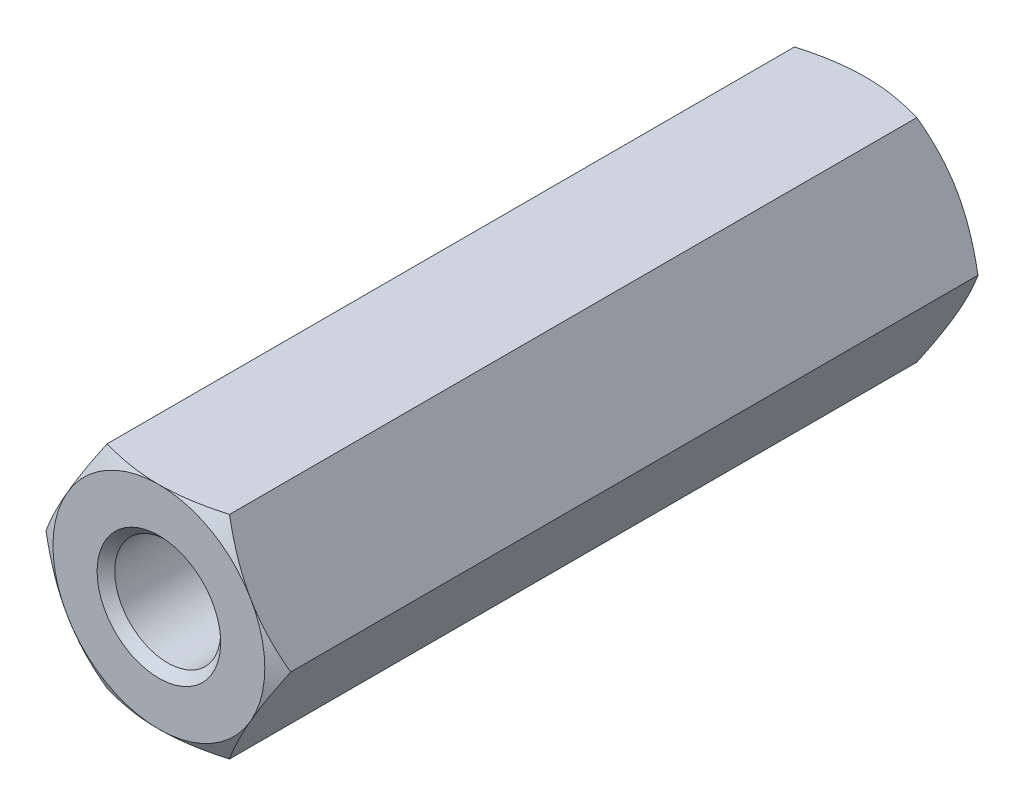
ISO-10303-21;
HEADER;
FILE_DESCRIPTION(('STEP AP214'),'2;1');
FILE_NAME('part.step','',(''),(''),'','','');
FILE_SCHEMA(('AUTOMOTIVE_DESIGN { 1 0 10303 214 1 1 1 1 }'));
ENDSEC;
DATA;
#1=APPLICATION_CONTEXT('core data for automotive mechanical design processes');
#2=APPLICATION_PROTOCOL_DEFINITION('international standard','automotive_design',2000,#1);
#3=PRODUCT_CONTEXT('',#1,'mechanical');
#4=PRODUCT('Part','Part','',(#3));
#5=PRODUCT_RELATED_PRODUCT_CATEGORY('part','',(#4));
#6=PRODUCT_DEFINITION_FORMATION('','',#4);
#7=PRODUCT_DEFINITION_CONTEXT('part definition',#1,'design');
#8=PRODUCT_DEFINITION('design','',#6,#7);
#9=PRODUCT_DEFINITION_SHAPE('','',#8);
#10=(LENGTH_UNIT() NAMED_UNIT(*) SI_UNIT(.MILLI.,.METRE.));
#11=(NAMED_UNIT(*) PLANE_ANGLE_UNIT() SI_UNIT($,.RADIAN.));
#12=(NAMED_UNIT(*) SI_UNIT($,.STERADIAN.) SOLID_ANGLE_UNIT());
#13=UNCERTAINTY_MEASURE_WITH_UNIT(LENGTH_MEASURE(1.E-05),#10,'distance_accuracy_value','');
#14=(GEOMETRIC_REPRESENTATION_CONTEXT(3) GLOBAL_UNCERTAINTY_ASSIGNED_CONTEXT((#13)) GLOBAL_UNIT_ASSIGNED_CONTEXT((#10,
#11,#12)) REPRESENTATION_CONTEXT('',''));
#15=CARTESIAN_POINT('',(0.,0.,0.));
#16=DIRECTION('',(0.,0.,1.));
#17=DIRECTION('',(1.,0.,0.));
#18=AXIS2_PLACEMENT_3D('',#15,#16,#17);
#19=CARTESIAN_POINT('',(3.46410161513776,0.,-10.));
#20=DIRECTION('',(0.866025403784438,0.5,0.));
#21=DIRECTION('',(-0.5,0.866025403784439,0.));
#22=AXIS2_PLACEMENT_3D('',#19,#20,#21);
#23=PLANE('',#22);
#24=CARTESIAN_POINT('',(3.46421708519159,-0.000199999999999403,9.73198413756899));
#25=CARTESIAN_POINT('',(3.38810199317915,0.131635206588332,9.77594629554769));
#26=CARTESIAN_POINT('',(3.31132988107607,0.26460840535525,9.81592841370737));
#27=CARTESIAN_POINT('',(3.15645624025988,0.532857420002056,9.88571791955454));
#28=CARTESIAN_POINT('',(3.078351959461,0.668138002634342,9.91550061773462));
#29=CARTESIAN_POINT('',(2.92311136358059,0.937022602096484,9.96186216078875));
#30=CARTESIAN_POINT('',(2.84599893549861,1.07058524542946,9.97874955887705));
#31=CARTESIAN_POINT('',(2.6914112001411,1.33833905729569,9.99891035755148));
#32=CARTESIAN_POINT('',(2.61393645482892,1.47252925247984,10.0022004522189));
#33=CARTESIAN_POINT('',(2.46916798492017,1.72327559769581,9.99535946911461));
#34=CARTESIAN_POINT('',(2.40185259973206,1.83986926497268,9.98690808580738));
#35=CARTESIAN_POINT('',(2.2676603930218,2.07229698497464,9.96012105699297));
#36=CARTESIAN_POINT('',(2.2007840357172,2.18813023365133,9.94177625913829));
#37=CARTESIAN_POINT('',(2.06631510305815,2.42103725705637,9.89591524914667));
#38=CARTESIAN_POINT('',(1.99873954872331,2.53808155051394,9.86820461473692));
#39=CARTESIAN_POINT('',(1.86459637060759,2.77042435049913,9.8053122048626));
#40=CARTESIAN_POINT('',(1.79802702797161,2.88572583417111,9.77014520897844));
#41=CARTESIAN_POINT('',(1.73193533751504,3.0002,9.73198413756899));
#42=B_SPLINE_CURVE_WITH_KNOTS('',3,(#24,#25,#26,#27,#28,#29,#30,#31,#32,#33,#34,#35,#36,#37,#38,
#39,#40,#41),.UNSPECIFIED.,.F.,.F.,(4,2,2,2,2,2,2,2,4),(0.,0.475539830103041,0.952222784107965,
1.41710776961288,1.88142182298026,2.28572436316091,2.69040156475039,3.10405572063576,
3.5168974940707),.UNSPECIFIED.);
#43=CARTESIAN_POINT('',(3.46410161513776,0.,9.73205080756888));
#44=VERTEX_POINT('',#43);
#45=CARTESIAN_POINT('',(2.59807621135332,1.5,10.));
#46=VERTEX_POINT('',#45);
#47=EDGE_CURVE('E127',#44,#46,#42,.T.);
#48=ORIENTED_EDGE('',*,*,#47,.F.);
#49=DIRECTION('',(0.,0.,1.));
#50=VECTOR('',#49,1.);
#51=CARTESIAN_POINT('',(3.46410161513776,0.,-10.));
#52=LINE('',#51,#50);
#53=CARTESIAN_POINT('',(3.46410161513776,0.,-9.73205080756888));
#54=VERTEX_POINT('',#53);
#55=EDGE_CURVE('E569',#54,#44,#52,.T.);
#56=ORIENTED_EDGE('',*,*,#55,.F.);
#57=CARTESIAN_POINT('',(3.46421708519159,-0.000199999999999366,-9.73198413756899));
#58=CARTESIAN_POINT('',(3.38810199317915,0.131635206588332,-9.77594629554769));
#59=CARTESIAN_POINT('',(3.31132988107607,0.26460840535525,-9.81592841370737));
#60=CARTESIAN_POINT('',(3.15645624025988,0.532857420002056,-9.88571791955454));
#61=CARTESIAN_POINT('',(3.078351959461,0.668138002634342,-9.91550061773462));
#62=CARTESIAN_POINT('',(2.92311136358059,0.937022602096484,-9.96186216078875));
#63=CARTESIAN_POINT('',(2.84599893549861,1.07058524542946,-9.97874955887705));
#64=CARTESIAN_POINT('',(2.6914112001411,1.33833905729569,-9.99891035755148));
#65=CARTESIAN_POINT('',(2.61393645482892,1.47252925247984,-10.0022004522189));
#66=CARTESIAN_POINT('',(2.46916798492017,1.72327559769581,-9.99535946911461));
#67=CARTESIAN_POINT('',(2.40185259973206,1.83986926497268,-9.98690808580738));
#68=CARTESIAN_POINT('',(2.2676603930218,2.07229698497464,-9.96012105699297));
#69=CARTESIAN_POINT('',(2.2007840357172,2.18813023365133,-9.94177625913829));
#70=CARTESIAN_POINT('',(2.06631510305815,2.42103725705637,-9.89591524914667));
#71=CARTESIAN_POINT('',(1.99873954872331,2.53808155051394,-9.86820461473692));
#72=CARTESIAN_POINT('',(1.86459637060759,2.77042435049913,-9.8053122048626));
#73=CARTESIAN_POINT('',(1.79802702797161,2.88572583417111,-9.77014520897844));
#74=CARTESIAN_POINT('',(1.73193533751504,3.0002,-9.73198413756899));
#75=B_SPLINE_CURVE_WITH_KNOTS('',3,(#57,#58,#59,#60,#61,#62,#63,#64,#65,#66,#67,#68,#69,#70,#71,
#72,#73,#74),.UNSPECIFIED.,.F.,.F.,(4,2,2,2,2,2,2,2,4),(0.,0.475539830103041,0.952222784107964,
1.41710776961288,1.88142182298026,2.28572436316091,2.69040156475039,3.10405572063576,
3.5168974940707),.UNSPECIFIED.);
#76=CARTESIAN_POINT('',(2.59807621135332,1.5,-10.));
#77=VERTEX_POINT('',#76);
#78=EDGE_CURVE('E544',#54,#77,#75,.T.);
#79=ORIENTED_EDGE('',*,*,#78,.T.);
#80=CARTESIAN_POINT('',(1.73205080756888,3.,-9.73205080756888));
#81=VERTEX_POINT('',#80);
#82=EDGE_CURVE('E268',#77,#81,#75,.T.);
#83=ORIENTED_EDGE('',*,*,#82,.T.);
#84=DIRECTION('',(0.,0.,1.));
#85=VECTOR('',#84,1.);
#86=CARTESIAN_POINT('',(1.73205080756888,3.,-10.));
#87=LINE('',#86,#85);
#88=CARTESIAN_POINT('',(1.73205080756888,3.,9.73205080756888));
#89=VERTEX_POINT('',#88);
#90=EDGE_CURVE('E159',#81,#89,#87,.T.);
#91=ORIENTED_EDGE('',*,*,#90,.T.);
#92=EDGE_CURVE('E140',#46,#89,#42,.T.);
#93=ORIENTED_EDGE('',*,*,#92,.F.);
#94=EDGE_LOOP('',(#48,#56,#79,#83,#91,#93));
#95=FACE_BOUND('',#94,.T.);
#96=ADVANCED_FACE('F41',(#95),#23,.T.);
#97=CARTESIAN_POINT('',(1.73205080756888,-3.,-10.));
#98=DIRECTION('',(0.866025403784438,-0.5,0.));
#99=DIRECTION('',(0.5,0.866025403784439,0.));
#100=AXIS2_PLACEMENT_3D('',#97,#98,#99);
#101=PLANE('',#100);
#102=CARTESIAN_POINT('',(1.73193533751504,-3.0002,9.73198413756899));
#103=CARTESIAN_POINT('',(1.80805042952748,-2.86836479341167,9.77594629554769));
#104=CARTESIAN_POINT('',(1.88482254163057,-2.73539159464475,9.81592841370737));
#105=CARTESIAN_POINT('',(2.03969618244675,-2.46714257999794,9.88571791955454));
#106=CARTESIAN_POINT('',(2.11780046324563,-2.33186199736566,9.91550061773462));
#107=CARTESIAN_POINT('',(2.27304105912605,-2.06297739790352,9.96186216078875));
#108=CARTESIAN_POINT('',(2.35015348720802,-1.92941475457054,9.97874955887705));
#109=CARTESIAN_POINT('',(2.50474122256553,-1.66166094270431,9.99891035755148));
#110=CARTESIAN_POINT('',(2.58221596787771,-1.52747074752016,10.0022004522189));
#111=CARTESIAN_POINT('',(2.72698443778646,-1.27672440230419,9.99535946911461));
#112=CARTESIAN_POINT('',(2.79429982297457,-1.16013073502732,9.98690808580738));
#113=CARTESIAN_POINT('',(2.92849202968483,-0.927703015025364,9.96012105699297));
#114=CARTESIAN_POINT('',(2.99536838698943,-0.811869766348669,9.94177625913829));
#115=CARTESIAN_POINT('',(3.12983731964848,-0.578962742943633,9.89591524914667));
#116=CARTESIAN_POINT('',(3.19741287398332,-0.461918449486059,9.86820461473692));
#117=CARTESIAN_POINT('',(3.33155605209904,-0.229575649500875,9.8053122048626));
#118=CARTESIAN_POINT('',(3.39812539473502,-0.114274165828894,9.77014520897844));
#119=CARTESIAN_POINT('',(3.46421708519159,0.000200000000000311,9.73198413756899));
#120=B_SPLINE_CURVE_WITH_KNOTS('',3,(#102,#103,#104,#105,#106,#107,#108,#109,#110,#111,#112,
#113,#114,#115,#116,#117,#118,#119),.UNSPECIFIED.,.F.,.F.,(4,2,2,2,2,2,2,2,4),(0.,
0.47553983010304,0.952222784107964,1.41710776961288,1.88142182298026,2.28572436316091,
2.69040156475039,3.10405572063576,3.5168974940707),.UNSPECIFIED.);
#121=CARTESIAN_POINT('',(1.73205080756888,-3.,9.73205080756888));
#122=VERTEX_POINT('',#121);
#123=CARTESIAN_POINT('',(2.59807621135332,-1.5,10.));
#124=VERTEX_POINT('',#123);
#125=EDGE_CURVE('E551',#122,#124,#120,.T.);
#126=ORIENTED_EDGE('',*,*,#125,.F.);
#127=DIRECTION('',(0.,0.,1.));
#128=VECTOR('',#127,1.);
#129=CARTESIAN_POINT('',(1.73205080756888,-3.,-10.));
#130=LINE('',#129,#128);
#131=CARTESIAN_POINT('',(1.73205080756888,-3.,-9.73205080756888));
#132=VERTEX_POINT('',#131);
#133=EDGE_CURVE('E282',#132,#122,#130,.T.);
#134=ORIENTED_EDGE('',*,*,#133,.F.);
#135=CARTESIAN_POINT('',(1.73193533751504,-3.0002,-9.73198413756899));
#136=CARTESIAN_POINT('',(1.80805042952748,-2.86836479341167,-9.77594629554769));
#137=CARTESIAN_POINT('',(1.88482254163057,-2.73539159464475,-9.81592841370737));
#138=CARTESIAN_POINT('',(2.03969618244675,-2.46714257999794,-9.88571791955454));
#139=CARTESIAN_POINT('',(2.11780046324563,-2.33186199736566,-9.91550061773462));
#140=CARTESIAN_POINT('',(2.27304105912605,-2.06297739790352,-9.96186216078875));
#141=CARTESIAN_POINT('',(2.35015348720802,-1.92941475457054,-9.97874955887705));
#142=CARTESIAN_POINT('',(2.50474122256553,-1.66166094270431,-9.99891035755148));
#143=CARTESIAN_POINT('',(2.58221596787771,-1.52747074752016,-10.0022004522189));
#144=CARTESIAN_POINT('',(2.72698443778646,-1.27672440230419,-9.99535946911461));
#145=CARTESIAN_POINT('',(2.79429982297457,-1.16013073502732,-9.98690808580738));
#146=CARTESIAN_POINT('',(2.92849202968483,-0.927703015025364,-9.96012105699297));
#147=CARTESIAN_POINT('',(2.99536838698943,-0.811869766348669,-9.94177625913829));
#148=CARTESIAN_POINT('',(3.12983731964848,-0.578962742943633,-9.89591524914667));
#149=CARTESIAN_POINT('',(3.19741287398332,-0.461918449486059,-9.86820461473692));
#150=CARTESIAN_POINT('',(3.33155605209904,-0.229575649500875,-9.8053122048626));
#151=CARTESIAN_POINT('',(3.39812539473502,-0.114274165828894,-9.77014520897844));
#152=CARTESIAN_POINT('',(3.46421708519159,0.000200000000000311,-9.73198413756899));
#153=B_SPLINE_CURVE_WITH_KNOTS('',3,(#135,#136,#137,#138,#139,#140,#141,#142,#143,#144,#145,
#146,#147,#148,#149,#150,#151,#152),.UNSPECIFIED.,.F.,.F.,(4,2,2,2,2,2,2,2,4),(0.,
0.47553983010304,0.952222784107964,1.41710776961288,1.88142182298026,2.28572436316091,
2.69040156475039,3.10405572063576,3.5168974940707),.UNSPECIFIED.);
#154=CARTESIAN_POINT('',(2.59807621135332,-1.5,-10.));
#155=VERTEX_POINT('',#154);
#156=EDGE_CURVE('E570',#132,#155,#153,.T.);
#157=ORIENTED_EDGE('',*,*,#156,.T.);
#158=EDGE_CURVE('E283',#155,#54,#153,.T.);
#159=ORIENTED_EDGE('',*,*,#158,.T.);
#160=ORIENTED_EDGE('',*,*,#55,.T.);
#161=EDGE_CURVE('E132',#124,#44,#120,.T.);
#162=ORIENTED_EDGE('',*,*,#161,.F.);
#163=EDGE_LOOP('',(#126,#134,#157,#159,#160,#162));
#164=FACE_BOUND('',#163,.T.);
#165=ADVANCED_FACE('F253',(#164),#101,.T.);
#166=CARTESIAN_POINT('',(-1.73205080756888,-3.,-10.));
#167=DIRECTION('',(0.,-1.,0.));
#168=DIRECTION('',(0.,0.,-1.));
#169=AXIS2_PLACEMENT_3D('',#166,#167,#168);
#170=PLANE('',#169);
#171=CARTESIAN_POINT('',(-16.7055640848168,-3.,1.9328013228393));
#172=CARTESIAN_POINT('',(-16.3456649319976,-3.,2.13731276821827));
#173=CARTESIAN_POINT('',(-15.9856809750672,-3.,2.34167518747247));
#174=CARTESIAN_POINT('',(-15.2654961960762,-3.,2.75001890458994));
#175=CARTESIAN_POINT('',(-14.9052953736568,-3.,2.95400020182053));
#176=CARTESIAN_POINT('',(-14.1845930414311,-3.,3.36151927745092));
#177=CARTESIAN_POINT('',(-13.8240915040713,-3.,3.56505700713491));
#178=CARTESIAN_POINT('',(-13.1027599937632,-3.,3.97154918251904));
#179=CARTESIAN_POINT('',(-12.741930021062,-3.,4.17450362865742));
#180=CARTESIAN_POINT('',(-12.0221144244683,-3.,4.57840160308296));
#181=CARTESIAN_POINT('',(-11.6631314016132,-3.,4.77934976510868));
#182=CARTESIAN_POINT('',(-10.9446345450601,-3.,5.1802947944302));
#183=CARTESIAN_POINT('',(-10.5851207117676,-3.,5.38029166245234));
#184=CARTESIAN_POINT('',(-9.86541578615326,-3.,5.77900814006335));
#185=CARTESIAN_POINT('',(-9.50522473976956,-3.,5.97772783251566));
#186=CARTESIAN_POINT('',(-8.78389553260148,-3.,6.37343957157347));
#187=CARTESIAN_POINT('',(-8.42275737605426,-3.,6.57043162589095));
#188=CARTESIAN_POINT('',(-7.69444466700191,-3.,6.96451765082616));
#189=CARTESIAN_POINT('',(-7.32725274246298,-3.,7.16157955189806));
#190=CARTESIAN_POINT('',(-6.59085024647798,-3.,7.55202511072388));
#191=CARTESIAN_POINT('',(-6.22163943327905,-3.,7.74540831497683));
#192=CARTESIAN_POINT('',(-5.6646064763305,-3.,8.03157116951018));
#193=CARTESIAN_POINT('',(-5.47791220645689,-3.,8.12654407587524));
#194=CARTESIAN_POINT('',(-5.10355589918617,-3.,8.31456038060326));
#195=CARTESIAN_POINT('',(-4.91589387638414,-3.,8.40760380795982));
#196=CARTESIAN_POINT('',(-4.53937251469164,-3.,8.59115268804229));
#197=CARTESIAN_POINT('',(-4.35051340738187,-3.,8.68165861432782));
#198=CARTESIAN_POINT('',(-3.97121706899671,-3.,8.85929073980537));
#199=CARTESIAN_POINT('',(-3.78077991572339,-3.,8.94641710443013));
#200=CARTESIAN_POINT('',(-3.38575425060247,-3.,9.12141585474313));
#201=CARTESIAN_POINT('',(-3.18103163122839,-3.,9.2089877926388));
#202=CARTESIAN_POINT('',(-2.76846231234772,-3.,9.37670977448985));
#203=CARTESIAN_POINT('',(-2.5606147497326,-3.,9.45685772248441));
#204=CARTESIAN_POINT('',(-2.14254792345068,-3.,9.60573891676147));
#205=CARTESIAN_POINT('',(-1.93235782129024,-3.,9.67455267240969));
#206=CARTESIAN_POINT('',(-1.50744067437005,-3.,9.79654616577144));
#207=CARTESIAN_POINT('',(-1.29271622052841,-3.,9.84973458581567));
#208=CARTESIAN_POINT('',(-0.912111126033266,-3.,9.9238966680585));
#209=CARTESIAN_POINT('',(-0.747165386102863,-3.,9.94957170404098));
#210=CARTESIAN_POINT('',(-0.41564138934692,-3.,9.98597404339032));
#211=CARTESIAN_POINT('',(-0.249063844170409,-3.,9.99670759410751));
#212=CARTESIAN_POINT('',(0.0845580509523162,-3.,10.001990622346));
#213=CARTESIAN_POINT('',(0.251602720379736,-3.,9.99652085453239));
#214=CARTESIAN_POINT('',(0.584430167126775,-3.,9.97001251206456));
#215=CARTESIAN_POINT('',(0.75021266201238,-3.,9.94897055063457));
#216=CARTESIAN_POINT('',(1.24506059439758,-3.,9.86566463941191));
#217=CARTESIAN_POINT('',(1.57069736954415,-3.,9.78322603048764));
#218=CARTESIAN_POINT('',(2.05133261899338,-3.,9.63526578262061));
#219=CARTESIAN_POINT('',(2.21048554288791,-3.,9.5817918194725));
#220=CARTESIAN_POINT('',(2.52660580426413,-3.,9.46869319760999));
#221=CARTESIAN_POINT('',(2.68357351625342,-3.,9.40906960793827));
#222=CARTESIAN_POINT('',(2.99922656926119,-3.,9.28379142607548));
#223=CARTESIAN_POINT('',(3.15786868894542,-3.,9.21802984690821));
#224=CARTESIAN_POINT('',(3.47359241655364,-3.,9.08285970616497));
#225=CARTESIAN_POINT('',(3.63067398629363,-3.,9.01345105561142));
#226=CARTESIAN_POINT('',(3.94333604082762,-3.,8.87195215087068));
#227=CARTESIAN_POINT('',(4.09891841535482,-3.,8.79986605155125));
#228=CARTESIAN_POINT('',(4.40905676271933,-3.,8.65353284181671));
#229=CARTESIAN_POINT('',(4.56361275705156,-3.,8.57928577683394));
#230=CARTESIAN_POINT('',(4.98781478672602,-3.,8.37262718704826));
#231=CARTESIAN_POINT('',(5.25660600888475,-3.,8.2384632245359));
#232=CARTESIAN_POINT('',(5.79240214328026,-3.,7.96660766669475));
#233=CARTESIAN_POINT('',(6.05940698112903,-3.,7.82891592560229));
#234=CARTESIAN_POINT('',(6.59213952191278,-3.,7.55101125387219));
#235=CARTESIAN_POINT('',(6.85786706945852,-3.,7.41079802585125));
#236=CARTESIAN_POINT('',(7.38834510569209,-3.,7.1285335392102));
#237=CARTESIAN_POINT('',(7.6530955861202,-3.,6.98648226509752));
#238=CARTESIAN_POINT('',(8.44676143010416,-3.,6.55800513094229));
#239=CARTESIAN_POINT('',(8.97456983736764,-3.,6.26953052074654));
#240=CARTESIAN_POINT('',(10.0283465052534,-3.,5.68934287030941));
#241=CARTESIAN_POINT('',(10.5543148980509,-3.,5.39763006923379));
#242=CARTESIAN_POINT('',(11.5501476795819,-3.,4.8426666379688));
#243=CARTESIAN_POINT('',(12.0201302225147,-3.,4.57962789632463));
#244=CARTESIAN_POINT('',(12.9594205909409,-3.,4.05232441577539));
#245=CARTESIAN_POINT('',(13.4287284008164,-3.,3.78805964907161));
#246=CARTESIAN_POINT('',(14.366180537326,-3.,3.25900850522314));
#247=CARTESIAN_POINT('',(14.834325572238,-3.,2.99422338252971));
#248=CARTESIAN_POINT('',(15.7702142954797,-3.,2.46397308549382));
#249=CARTESIAN_POINT('',(16.2379579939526,-3.,2.19850792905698));
#250=CARTESIAN_POINT('',(16.7055640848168,-3.,1.9328013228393));
#251=B_SPLINE_CURVE_WITH_KNOTS('',3,(#171,#172,#173,#174,#175,#176,#177,#178,#179,#180,#181,
#182,#183,#184,#185,#186,#187,#188,#189,#190,#191,#192,#193,#194,#195,#196,#197,#198,#199,#200,
#201,#202,#203,#204,#205,#206,#207,#208,#209,#210,#211,#212,#213,#214,#215,#216,#217,#218,#219,
#220,#221,#222,#223,#224,#225,#226,#227,#228,#229,#230,#231,#232,#233,#234,#235,#236,#237,#238,
#239,#240,#241,#242,#243,#244,#245,#246,#247,#248,#249,#250),.UNSPECIFIED.,.F.,.F.,(4,2,2,2,2,2,
2,2,2,2,2,2,2,2,2,2,2,2,2,2,2,2,2,2,2,2,2,2,2,2,2,2,2,2,2,2,2,2,2,4),(0.,1.24184189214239,
2.48368584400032,3.72565992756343,4.96763307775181,6.20182841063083,7.43602280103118,
8.6701362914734,9.90424427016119,11.1544209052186,12.4047506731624,13.0331304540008,
13.6615007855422,14.2897530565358,14.9179745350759,15.585874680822,16.2539628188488,
16.9170790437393,17.5798261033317,18.080049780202,18.5800642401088,19.0806728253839,
19.5813903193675,20.5855749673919,21.0892565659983,21.5928507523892,22.1079992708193,
22.6231603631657,23.1375529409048,23.6519347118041,24.5531337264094,25.4543700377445,
26.3557133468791,27.2570642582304,29.0615336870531,30.865870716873,32.4816207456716,
34.0974075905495,35.7109243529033,37.3243990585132),.UNSPECIFIED.);
#252=CARTESIAN_POINT('',(-1.73205080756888,-3.,9.73205080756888));
#253=VERTEX_POINT('',#252);
#254=CARTESIAN_POINT('',(0.,-3.,10.));
#255=VERTEX_POINT('',#254);
#256=EDGE_CURVE('E549',#253,#255,#251,.T.);
#257=ORIENTED_EDGE('',*,*,#256,.F.);
#258=DIRECTION('',(0.,0.,1.));
#259=VECTOR('',#258,1.);
#260=CARTESIAN_POINT('',(-1.73205080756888,-3.,-10.));
#261=LINE('',#260,#259);
#262=CARTESIAN_POINT('',(-1.73205080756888,-3.,-9.73205080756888));
#263=VERTEX_POINT('',#262);
#264=EDGE_CURVE('E525',#263,#253,#261,.T.);
#265=ORIENTED_EDGE('',*,*,#264,.F.);
#266=CARTESIAN_POINT('',(-10.1079133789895,-3.,-5.64463447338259));
#267=CARTESIAN_POINT('',(-9.88519326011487,-3.,-5.76789979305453));
#268=CARTESIAN_POINT('',(-9.66233896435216,-3.,-5.89092355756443));
#269=CARTESIAN_POINT('',(-9.21628967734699,-3.,-6.13635712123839));
#270=CARTESIAN_POINT('',(-8.99309468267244,-3.,-6.25876691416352));
#271=CARTESIAN_POINT('',(-8.54619999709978,-3.,-6.50289171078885));
#272=CARTESIAN_POINT('',(-8.32250013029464,-3.,-6.62460639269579));
#273=CARTESIAN_POINT('',(-7.87459549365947,-3.,-6.86710155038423));
#274=CARTESIAN_POINT('',(-7.65039072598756,-3.,-6.98788203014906));
#275=CARTESIAN_POINT('',(-7.19859019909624,-3.,-7.22973857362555));
#276=CARTESIAN_POINT('',(-6.97098661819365,-3.,-7.35080004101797));
#277=CARTESIAN_POINT('',(-6.51495389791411,-3.,-7.59135751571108));
#278=CARTESIAN_POINT('',(-6.28652476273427,-3.,-7.71085353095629));
#279=CARTESIAN_POINT('',(-5.82863894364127,-3.,-7.94775447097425));
#280=CARTESIAN_POINT('',(-5.59918246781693,-3.,-8.06515979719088));
#281=CARTESIAN_POINT('',(-5.1388595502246,-3.,-8.29716865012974));
#282=CARTESIAN_POINT('',(-4.90799314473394,-3.,-8.41177224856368));
#283=CARTESIAN_POINT('',(-4.44174717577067,-3.,-8.63834356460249));
#284=CARTESIAN_POINT('',(-4.20634606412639,-3.,-8.75026707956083));
#285=CARTESIAN_POINT('',(-3.73281071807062,-3.,-8.96839546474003));
#286=CARTESIAN_POINT('',(-3.49467586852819,-3.,-9.07459901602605));
#287=CARTESIAN_POINT('',(-3.13476684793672,-3.,-9.22737320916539));
#288=CARTESIAN_POINT('',(-3.01437606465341,-3.,-9.27719793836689));
#289=CARTESIAN_POINT('',(-2.7725125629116,-3.,-9.37414009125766));
#290=CARTESIAN_POINT('',(-2.65103990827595,-3.,-9.42125767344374));
#291=CARTESIAN_POINT('',(-2.40685760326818,-3.,-9.51212187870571));
#292=CARTESIAN_POINT('',(-2.28414818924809,-3.,-9.55586913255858));
#293=CARTESIAN_POINT('',(-2.03731754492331,-3.,-9.63915506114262));
#294=CARTESIAN_POINT('',(-1.91319646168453,-3.,-9.6786941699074));
#295=CARTESIAN_POINT('',(-1.6221773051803,-3.,-9.7647272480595));
#296=CARTESIAN_POINT('',(-1.45467224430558,-3.,-9.80921411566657));
#297=CARTESIAN_POINT('',(-1.11687818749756,-3.,-9.88602951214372));
#298=CARTESIAN_POINT('',(-0.946590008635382,-3.,-9.91836154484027));
#299=CARTESIAN_POINT('',(-0.605127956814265,-3.,-9.96766677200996));
#300=CARTESIAN_POINT('',(-0.43397222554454,-3.,-9.98476141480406));
#301=CARTESIAN_POINT('',(-0.0907996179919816,-3.,-10.0020143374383));
#302=CARTESIAN_POINT('',(0.0812171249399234,-3.,-10.002175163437));
#303=CARTESIAN_POINT('',(0.423526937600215,-3.,-9.98558899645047));
#304=CARTESIAN_POINT('',(0.593824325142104,-3.,-9.9689272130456));
#305=CARTESIAN_POINT('',(0.932301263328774,-3.,-9.92077192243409));
#306=CARTESIAN_POINT('',(1.10048016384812,-3.,-9.88927397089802));
#307=CARTESIAN_POINT('',(1.35226247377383,-3.,-9.83271157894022));
#308=CARTESIAN_POINT('',(1.43690215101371,-3.,-9.8120652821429));
#309=CARTESIAN_POINT('',(1.60547426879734,-3.,-9.76804979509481));
#310=CARTESIAN_POINT('',(1.68940670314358,-3.,-9.7446805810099));
#311=CARTESIAN_POINT('',(1.85656551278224,-3.,-9.69557880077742));
#312=CARTESIAN_POINT('',(1.93979194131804,-3.,-9.66984641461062));
#313=CARTESIAN_POINT('',(2.10557736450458,-3.,-9.61633654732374));
#314=CARTESIAN_POINT('',(2.1881363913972,-3.,-9.58855916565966));
#315=CARTESIAN_POINT('',(2.45362474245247,-3.,-9.49606809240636));
#316=CARTESIAN_POINT('',(2.63534329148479,-3.,-9.42787462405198));
#317=CARTESIAN_POINT('',(2.99632423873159,-3.,-9.285238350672));
#318=CARTESIAN_POINT('',(3.17558599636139,-3.,-9.21079395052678));
#319=CARTESIAN_POINT('',(3.53229537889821,-3.,-9.05729404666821));
#320=CARTESIAN_POINT('',(3.70974133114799,-3.,-8.97823467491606));
#321=CARTESIAN_POINT('',(4.06306754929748,-3.,-8.81675302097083));
#322=CARTESIAN_POINT('',(4.2389479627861,-3.,-8.73433105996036));
#323=CARTESIAN_POINT('',(4.59006547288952,-3.,-8.56666857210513));
#324=CARTESIAN_POINT('',(4.76529856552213,-3.,-8.48141968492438));
#325=CARTESIAN_POINT('',(5.11479211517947,-3.,-8.30894754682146));
#326=CARTESIAN_POINT('',(5.28905255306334,-3.,-8.22172425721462));
#327=CARTESIAN_POINT('',(5.8105045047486,-3.,-7.95785134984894));
#328=CARTESIAN_POINT('',(6.15653812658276,-3.,-7.77891567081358));
#329=CARTESIAN_POINT('',(6.80521231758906,-3.,-7.43884097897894));
#330=CARTESIAN_POINT('',(7.10808348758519,-3.,-7.27813903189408));
#331=CARTESIAN_POINT('',(7.71271702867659,-3.,-6.95456456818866));
#332=CARTESIAN_POINT('',(8.01447924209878,-3.,-6.79169175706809));
#333=CARTESIAN_POINT('',(8.61523614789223,-3.,-6.46542803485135));
#334=CARTESIAN_POINT('',(8.91423622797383,-3.,-6.30204702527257));
#335=CARTESIAN_POINT('',(9.51153886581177,-3.,-5.97412675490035));
#336=CARTESIAN_POINT('',(9.80984152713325,-3.,-5.80958768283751));
#337=CARTESIAN_POINT('',(10.1079133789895,-3.,-5.64463447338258));
#338=B_SPLINE_CURVE_WITH_KNOTS('',3,(#266,#267,#268,#269,#270,#271,#272,#273,#274,#275,#276,
#277,#278,#279,#280,#281,#282,#283,#284,#285,#286,#287,#288,#289,#290,#291,#292,#293,#294,#295,
#296,#297,#298,#299,#300,#301,#302,#303,#304,#305,#306,#307,#308,#309,#310,#311,#312,#313,#314,
#315,#316,#317,#318,#319,#320,#321,#322,#323,#324,#325,#326,#327,#328,#329,#330,#331,#332,#333,
#334,#335,#336,#337),.UNSPECIFIED.,.F.,.F.,(4,2,2,2,2,2,2,2,2,2,2,2,2,2,2,2,2,2,2,2,2,2,2,2,2,2,
2,2,2,2,2,2,2,2,2,4),(0.,0.76366750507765,1.52734275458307,2.29134676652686,3.05534751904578,
3.82873380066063,4.6021161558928,5.37534837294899,6.14856077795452,6.93047841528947,
7.71257558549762,8.10343149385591,8.49426449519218,8.88502417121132,9.2757435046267,
9.79532663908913,10.3147598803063,10.8300150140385,11.3451926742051,11.8577738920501,
12.3705087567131,12.6318377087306,12.8931689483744,13.1544803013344,13.4157789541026,
13.9978701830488,14.5801104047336,15.1628458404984,15.7455257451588,16.3301173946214,
16.9147205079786,18.0833552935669,19.1119403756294,20.140666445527,21.1628425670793,
22.1848557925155),.UNSPECIFIED.);
#339=CARTESIAN_POINT('',(0.,-3.,-10.));
#340=VERTEX_POINT('',#339);
#341=EDGE_CURVE('E556',#263,#340,#338,.T.);
#342=ORIENTED_EDGE('',*,*,#341,.T.);
#343=EDGE_CURVE('E258',#340,#132,#338,.T.);
#344=ORIENTED_EDGE('',*,*,#343,.T.);
#345=ORIENTED_EDGE('',*,*,#133,.T.);
#346=EDGE_CURVE('E138',#255,#122,#251,.T.);
#347=ORIENTED_EDGE('',*,*,#346,.F.);
#348=EDGE_LOOP('',(#257,#265,#342,#344,#345,#347));
#349=FACE_BOUND('',#348,.T.);
#350=ADVANCED_FACE('F291',(#349),#170,.T.);
#351=CARTESIAN_POINT('',(-3.46410161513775,0.,-10.));
#352=DIRECTION('',(-0.866025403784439,-0.5,0.));
#353=DIRECTION('',(0.5,-0.866025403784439,0.));
#354=AXIS2_PLACEMENT_3D('',#351,#352,#353);
#355=PLANE('',#354);
#356=CARTESIAN_POINT('',(-3.46421708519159,0.000200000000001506,9.73198413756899));
#357=CARTESIAN_POINT('',(-3.38810199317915,-0.131635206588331,9.77594629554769));
#358=CARTESIAN_POINT('',(-3.31132988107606,-0.264608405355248,9.81592841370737));
#359=CARTESIAN_POINT('',(-3.15645624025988,-0.532857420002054,9.88571791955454));
#360=CARTESIAN_POINT('',(-3.078351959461,-0.66813800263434,9.91550061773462));
#361=CARTESIAN_POINT('',(-2.92311136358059,-0.937022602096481,9.96186216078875));
#362=CARTESIAN_POINT('',(-2.84599893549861,-1.07058524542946,9.97874955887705));
#363=CARTESIAN_POINT('',(-2.6914112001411,-1.33833905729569,9.99891035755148));
#364=CARTESIAN_POINT('',(-2.61393645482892,-1.47252925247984,10.0022004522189));
#365=CARTESIAN_POINT('',(-2.46916798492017,-1.72327559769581,9.99535946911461));
#366=CARTESIAN_POINT('',(-2.40185259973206,-1.83986926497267,9.98690808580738));
#367=CARTESIAN_POINT('',(-2.2676603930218,-2.07229698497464,9.96012105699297));
#368=CARTESIAN_POINT('',(-2.2007840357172,-2.18813023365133,9.94177625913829));
#369=CARTESIAN_POINT('',(-2.06631510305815,-2.42103725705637,9.89591524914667));
#370=CARTESIAN_POINT('',(-1.99873954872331,-2.53808155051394,9.86820461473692));
#371=CARTESIAN_POINT('',(-1.86459637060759,-2.77042435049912,9.8053122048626));
#372=CARTESIAN_POINT('',(-1.79802702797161,-2.88572583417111,9.77014520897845));
#373=CARTESIAN_POINT('',(-1.73193533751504,-3.0002,9.73198413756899));
#374=B_SPLINE_CURVE_WITH_KNOTS('',3,(#356,#357,#358,#359,#360,#361,#362,#363,#364,#365,#366,
#367,#368,#369,#370,#371,#372,#373),.UNSPECIFIED.,.F.,.F.,(4,2,2,2,2,2,2,2,4),(0.,
0.475539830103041,0.952222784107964,1.41710776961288,1.88142182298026,2.28572436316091,
2.69040156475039,3.10405572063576,3.5168974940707),.UNSPECIFIED.);
#375=CARTESIAN_POINT('',(-3.46410161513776,0.,9.73205080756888));
#376=VERTEX_POINT('',#375);
#377=CARTESIAN_POINT('',(-2.59807621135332,-1.5,10.));
#378=VERTEX_POINT('',#377);
#379=EDGE_CURVE('E175',#376,#378,#374,.T.);
#380=ORIENTED_EDGE('',*,*,#379,.F.);
#381=DIRECTION('',(0.,0.,1.));
#382=VECTOR('',#381,1.);
#383=CARTESIAN_POINT('',(-3.46410161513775,0.,-10.));
#384=LINE('',#383,#382);
#385=CARTESIAN_POINT('',(-3.46410161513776,0.,-9.73205080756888));
#386=VERTEX_POINT('',#385);
#387=EDGE_CURVE('E539',#386,#376,#384,.T.);
#388=ORIENTED_EDGE('',*,*,#387,.F.);
#389=CARTESIAN_POINT('',(-3.46421708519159,0.000200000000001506,-9.73198413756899));
#390=CARTESIAN_POINT('',(-3.38810199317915,-0.131635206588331,-9.77594629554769));
#391=CARTESIAN_POINT('',(-3.31132988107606,-0.264608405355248,-9.81592841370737));
#392=CARTESIAN_POINT('',(-3.15645624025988,-0.532857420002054,-9.88571791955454));
#393=CARTESIAN_POINT('',(-3.078351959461,-0.66813800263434,-9.91550061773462));
#394=CARTESIAN_POINT('',(-2.92311136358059,-0.937022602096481,-9.96186216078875));
#395=CARTESIAN_POINT('',(-2.84599893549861,-1.07058524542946,-9.97874955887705));
#396=CARTESIAN_POINT('',(-2.6914112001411,-1.33833905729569,-9.99891035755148));
#397=CARTESIAN_POINT('',(-2.61393645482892,-1.47252925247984,-10.0022004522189));
#398=CARTESIAN_POINT('',(-2.46916798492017,-1.72327559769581,-9.99535946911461));
#399=CARTESIAN_POINT('',(-2.40185259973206,-1.83986926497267,-9.98690808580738));
#400=CARTESIAN_POINT('',(-2.2676603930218,-2.07229698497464,-9.96012105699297));
#401=CARTESIAN_POINT('',(-2.2007840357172,-2.18813023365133,-9.94177625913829));
#402=CARTESIAN_POINT('',(-2.06631510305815,-2.42103725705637,-9.89591524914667));
#403=CARTESIAN_POINT('',(-1.99873954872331,-2.53808155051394,-9.86820461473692));
#404=CARTESIAN_POINT('',(-1.86459637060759,-2.77042435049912,-9.8053122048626));
#405=CARTESIAN_POINT('',(-1.79802702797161,-2.88572583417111,-9.77014520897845));
#406=CARTESIAN_POINT('',(-1.73193533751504,-3.0002,-9.73198413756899));
#407=B_SPLINE_CURVE_WITH_KNOTS('',3,(#389,#390,#391,#392,#393,#394,#395,#396,#397,#398,#399,
#400,#401,#402,#403,#404,#405,#406),.UNSPECIFIED.,.F.,.F.,(4,2,2,2,2,2,2,2,4),(0.,
0.475539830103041,0.952222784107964,1.41710776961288,1.88142182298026,2.28572436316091,
2.69040156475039,3.10405572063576,3.5168974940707),.UNSPECIFIED.);
#408=CARTESIAN_POINT('',(-2.59807621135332,-1.5,-10.));
#409=VERTEX_POINT('',#408);
#410=EDGE_CURVE('E274',#386,#409,#407,.T.);
#411=ORIENTED_EDGE('',*,*,#410,.T.);
#412=EDGE_CURVE('E281',#409,#263,#407,.T.);
#413=ORIENTED_EDGE('',*,*,#412,.T.);
#414=ORIENTED_EDGE('',*,*,#264,.T.);
#415=EDGE_CURVE('E532',#378,#253,#374,.T.);
#416=ORIENTED_EDGE('',*,*,#415,.F.);
#417=EDGE_LOOP('',(#380,#388,#411,#413,#414,#416));
#418=FACE_BOUND('',#417,.T.);
#419=ADVANCED_FACE('F288',(#418),#355,.T.);
#420=CARTESIAN_POINT('',(-1.73205080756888,3.,-10.));
#421=DIRECTION('',(-0.866025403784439,0.5,0.));
#422=DIRECTION('',(-0.5,-0.866025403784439,0.));
#423=AXIS2_PLACEMENT_3D('',#420,#421,#422);
#424=PLANE('',#423);
#425=CARTESIAN_POINT('',(-1.73193533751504,3.0002,9.73198413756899));
#426=CARTESIAN_POINT('',(-1.80805042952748,2.86836479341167,9.77594629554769));
#427=CARTESIAN_POINT('',(-1.88482254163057,2.73539159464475,9.81592841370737));
#428=CARTESIAN_POINT('',(-2.03969618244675,2.46714257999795,9.88571791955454));
#429=CARTESIAN_POINT('',(-2.11780046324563,2.33186199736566,9.91550061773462));
#430=CARTESIAN_POINT('',(-2.27304105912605,2.06297739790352,9.96186216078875));
#431=CARTESIAN_POINT('',(-2.35015348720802,1.92941475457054,9.97874955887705));
#432=CARTESIAN_POINT('',(-2.50474122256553,1.66166094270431,9.99891035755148));
#433=CARTESIAN_POINT('',(-2.58221596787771,1.52747074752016,10.0022004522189));
#434=CARTESIAN_POINT('',(-2.72698443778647,1.27672440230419,9.99535946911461));
#435=CARTESIAN_POINT('',(-2.79429982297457,1.16013073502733,9.98690808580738));
#436=CARTESIAN_POINT('',(-2.92849202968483,0.927703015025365,9.96012105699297));
#437=CARTESIAN_POINT('',(-2.99536838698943,0.81186976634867,9.94177625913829));
#438=CARTESIAN_POINT('',(-3.12983731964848,0.578962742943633,9.89591524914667));
#439=CARTESIAN_POINT('',(-3.19741287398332,0.46191844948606,9.86820461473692));
#440=CARTESIAN_POINT('',(-3.33155605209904,0.229575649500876,9.8053122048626));
#441=CARTESIAN_POINT('',(-3.39812539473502,0.114274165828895,9.77014520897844));
#442=CARTESIAN_POINT('',(-3.46421708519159,-0.000199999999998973,9.73198413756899));
#443=B_SPLINE_CURVE_WITH_KNOTS('',3,(#425,#426,#427,#428,#429,#430,#431,#432,#433,#434,#435,
#436,#437,#438,#439,#440,#441,#442),.UNSPECIFIED.,.F.,.F.,(4,2,2,2,2,2,2,2,4),(0.,
0.475539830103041,0.952222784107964,1.41710776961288,1.88142182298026,2.28572436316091,
2.69040156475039,3.10405572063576,3.5168974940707),.UNSPECIFIED.);
#444=CARTESIAN_POINT('',(-1.73205080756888,3.,9.73205080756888));
#445=VERTEX_POINT('',#444);
#446=CARTESIAN_POINT('',(-2.59807621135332,1.5,10.));
#447=VERTEX_POINT('',#446);
#448=EDGE_CURVE('E182',#445,#447,#443,.T.);
#449=ORIENTED_EDGE('',*,*,#448,.F.);
#450=DIRECTION('',(0.,0.,1.));
#451=VECTOR('',#450,1.);
#452=CARTESIAN_POINT('',(-1.73205080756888,3.,-10.));
#453=LINE('',#452,#451);
#454=CARTESIAN_POINT('',(-1.73205080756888,3.,-9.73205080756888));
#455=VERTEX_POINT('',#454);
#456=EDGE_CURVE('E232',#455,#445,#453,.T.);
#457=ORIENTED_EDGE('',*,*,#456,.F.);
#458=CARTESIAN_POINT('',(-1.73193533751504,3.0002,-9.73198413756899));
#459=CARTESIAN_POINT('',(-1.80805042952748,2.86836479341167,-9.77594629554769));
#460=CARTESIAN_POINT('',(-1.88482254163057,2.73539159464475,-9.81592841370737));
#461=CARTESIAN_POINT('',(-2.03969618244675,2.46714257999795,-9.88571791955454));
#462=CARTESIAN_POINT('',(-2.11780046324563,2.33186199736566,-9.91550061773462));
#463=CARTESIAN_POINT('',(-2.27304105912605,2.06297739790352,-9.96186216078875));
#464=CARTESIAN_POINT('',(-2.35015348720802,1.92941475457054,-9.97874955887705));
#465=CARTESIAN_POINT('',(-2.50474122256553,1.66166094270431,-9.99891035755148));
#466=CARTESIAN_POINT('',(-2.58221596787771,1.52747074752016,-10.0022004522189));
#467=CARTESIAN_POINT('',(-2.72698443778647,1.27672440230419,-9.99535946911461));
#468=CARTESIAN_POINT('',(-2.79429982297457,1.16013073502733,-9.98690808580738));
#469=CARTESIAN_POINT('',(-2.92849202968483,0.927703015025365,-9.96012105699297));
#470=CARTESIAN_POINT('',(-2.99536838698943,0.81186976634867,-9.94177625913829));
#471=CARTESIAN_POINT('',(-3.12983731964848,0.578962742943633,-9.89591524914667));
#472=CARTESIAN_POINT('',(-3.19741287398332,0.46191844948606,-9.86820461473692));
#473=CARTESIAN_POINT('',(-3.33155605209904,0.229575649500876,-9.8053122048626));
#474=CARTESIAN_POINT('',(-3.39812539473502,0.114274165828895,-9.77014520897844));
#475=CARTESIAN_POINT('',(-3.46421708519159,-0.000199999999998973,-9.73198413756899));
#476=B_SPLINE_CURVE_WITH_KNOTS('',3,(#458,#459,#460,#461,#462,#463,#464,#465,#466,#467,#468,
#469,#470,#471,#472,#473,#474,#475),.UNSPECIFIED.,.F.,.F.,(4,2,2,2,2,2,2,2,4),(0.,
0.475539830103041,0.952222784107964,1.41710776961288,1.88142182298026,2.28572436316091,
2.69040156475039,3.10405572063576,3.5168974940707),.UNSPECIFIED.);
#477=CARTESIAN_POINT('',(-2.59807621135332,1.5,-10.));
#478=VERTEX_POINT('',#477);
#479=EDGE_CURVE('E236',#455,#478,#476,.T.);
#480=ORIENTED_EDGE('',*,*,#479,.T.);
#481=EDGE_CURVE('E542',#478,#386,#476,.T.);
#482=ORIENTED_EDGE('',*,*,#481,.T.);
#483=ORIENTED_EDGE('',*,*,#387,.T.);
#484=EDGE_CURVE('E530',#447,#376,#443,.T.);
#485=ORIENTED_EDGE('',*,*,#484,.F.);
#486=EDGE_LOOP('',(#449,#457,#480,#482,#483,#485));
#487=FACE_BOUND('',#486,.T.);
#488=ADVANCED_FACE('F217',(#487),#424,.T.);
#489=CARTESIAN_POINT('',(1.73205080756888,3.,-10.));
#490=DIRECTION('',(0.,1.,0.));
#491=DIRECTION('',(-1.,0.,0.));
#492=AXIS2_PLACEMENT_3D('',#489,#490,#491);
#493=PLANE('',#492);
#494=CARTESIAN_POINT('',(16.7055640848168,3.,1.9328013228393));
#495=CARTESIAN_POINT('',(16.3456649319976,3.,2.13731276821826));
#496=CARTESIAN_POINT('',(15.9856809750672,3.,2.34167518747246));
#497=CARTESIAN_POINT('',(15.2654961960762,3.,2.75001890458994));
#498=CARTESIAN_POINT('',(14.9052953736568,3.,2.95400020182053));
#499=CARTESIAN_POINT('',(14.1845930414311,3.,3.36151927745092));
#500=CARTESIAN_POINT('',(13.8240915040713,3.,3.56505700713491));
#501=CARTESIAN_POINT('',(13.1027599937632,3.,3.97154918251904));
#502=CARTESIAN_POINT('',(12.741930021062,3.,4.17450362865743));
#503=CARTESIAN_POINT('',(12.0221144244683,3.,4.57840160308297));
#504=CARTESIAN_POINT('',(11.6631314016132,3.,4.77934976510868));
#505=CARTESIAN_POINT('',(10.94463454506,3.,5.18029479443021));
#506=CARTESIAN_POINT('',(10.5851207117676,3.,5.38029166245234));
#507=CARTESIAN_POINT('',(9.86541578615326,3.,5.77900814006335));
#508=CARTESIAN_POINT('',(9.50522473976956,3.,5.97772783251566));
#509=CARTESIAN_POINT('',(8.78389553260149,3.,6.37343957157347));
#510=CARTESIAN_POINT('',(8.42275737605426,3.,6.57043162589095));
#511=CARTESIAN_POINT('',(7.69444466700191,3.,6.96451765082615));
#512=CARTESIAN_POINT('',(7.32725274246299,3.,7.16157955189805));
#513=CARTESIAN_POINT('',(6.59085024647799,3.,7.55202511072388));
#514=CARTESIAN_POINT('',(6.22163943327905,3.,7.74540831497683));
#515=CARTESIAN_POINT('',(5.66460647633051,3.,8.03157116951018));
#516=CARTESIAN_POINT('',(5.4779122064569,3.,8.12654407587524));
#517=CARTESIAN_POINT('',(5.10355589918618,3.,8.31456038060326));
#518=CARTESIAN_POINT('',(4.91589387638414,3.,8.40760380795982));
#519=CARTESIAN_POINT('',(4.53937251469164,3.,8.59115268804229));
#520=CARTESIAN_POINT('',(4.35051340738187,3.,8.68165861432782));
#521=CARTESIAN_POINT('',(3.97121706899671,3.,8.85929073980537));
#522=CARTESIAN_POINT('',(3.78077991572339,3.,8.94641710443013));
#523=CARTESIAN_POINT('',(3.38575425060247,3.,9.12141585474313));
#524=CARTESIAN_POINT('',(3.18103163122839,3.,9.2089877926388));
#525=CARTESIAN_POINT('',(2.76846231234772,3.,9.37670977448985));
#526=CARTESIAN_POINT('',(2.5606147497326,3.,9.45685772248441));
#527=CARTESIAN_POINT('',(2.14254792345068,3.,9.60573891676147));
#528=CARTESIAN_POINT('',(1.93235782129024,3.,9.67455267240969));
#529=CARTESIAN_POINT('',(1.50744067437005,3.,9.79654616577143));
#530=CARTESIAN_POINT('',(1.29271622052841,3.,9.84973458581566));
#531=CARTESIAN_POINT('',(0.912111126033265,3.,9.9238966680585));
#532=CARTESIAN_POINT('',(0.747165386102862,3.,9.94957170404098));
#533=CARTESIAN_POINT('',(0.415641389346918,3.,9.98597404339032));
#534=CARTESIAN_POINT('',(0.249063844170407,3.,9.99670759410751));
#535=CARTESIAN_POINT('',(-0.0845580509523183,3.,10.001990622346));
#536=CARTESIAN_POINT('',(-0.251602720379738,3.,9.99652085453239));
#537=CARTESIAN_POINT('',(-0.584430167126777,3.,9.97001251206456));
#538=CARTESIAN_POINT('',(-0.750212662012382,3.,9.94897055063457));
#539=CARTESIAN_POINT('',(-1.24506059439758,3.,9.86566463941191));
#540=CARTESIAN_POINT('',(-1.57069736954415,3.,9.78322603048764));
#541=CARTESIAN_POINT('',(-2.05133261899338,3.,9.63526578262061));
#542=CARTESIAN_POINT('',(-2.21048554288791,3.,9.5817918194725));
#543=CARTESIAN_POINT('',(-2.52660580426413,3.,9.46869319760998));
#544=CARTESIAN_POINT('',(-2.68357351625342,3.,9.40906960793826));
#545=CARTESIAN_POINT('',(-2.99922656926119,3.,9.28379142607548));
#546=CARTESIAN_POINT('',(-3.15786868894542,3.,9.21802984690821));
#547=CARTESIAN_POINT('',(-3.47359241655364,3.,9.08285970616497));
#548=CARTESIAN_POINT('',(-3.63067398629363,3.,9.01345105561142));
#549=CARTESIAN_POINT('',(-3.94333604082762,3.,8.87195215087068));
#550=CARTESIAN_POINT('',(-4.09891841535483,3.,8.79986605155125));
#551=CARTESIAN_POINT('',(-4.40905676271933,3.,8.65353284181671));
#552=CARTESIAN_POINT('',(-4.56361275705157,3.,8.57928577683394));
#553=CARTESIAN_POINT('',(-4.98781478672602,3.,8.37262718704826));
#554=CARTESIAN_POINT('',(-5.25660600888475,3.,8.23846322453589));
#555=CARTESIAN_POINT('',(-5.79240214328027,3.,7.96660766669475));
#556=CARTESIAN_POINT('',(-6.05940698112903,3.,7.82891592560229));
#557=CARTESIAN_POINT('',(-6.59213952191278,3.,7.55101125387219));
#558=CARTESIAN_POINT('',(-6.85786706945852,3.,7.41079802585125));
#559=CARTESIAN_POINT('',(-7.38834510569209,3.,7.1285335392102));
#560=CARTESIAN_POINT('',(-7.6530955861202,3.,6.98648226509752));
#561=CARTESIAN_POINT('',(-8.44676143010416,3.,6.55800513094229));
#562=CARTESIAN_POINT('',(-8.97456983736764,3.,6.26953052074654));
#563=CARTESIAN_POINT('',(-10.0283465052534,3.,5.68934287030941));
#564=CARTESIAN_POINT('',(-10.5543148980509,3.,5.39763006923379));
#565=CARTESIAN_POINT('',(-11.5501476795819,3.,4.84266663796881));
#566=CARTESIAN_POINT('',(-12.0201302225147,3.,4.57962789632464));
#567=CARTESIAN_POINT('',(-12.9594205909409,3.,4.05232441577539));
#568=CARTESIAN_POINT('',(-13.4287284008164,3.,3.78805964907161));
#569=CARTESIAN_POINT('',(-14.366180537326,3.,3.25900850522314));
#570=CARTESIAN_POINT('',(-14.834325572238,3.,2.99422338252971));
#571=CARTESIAN_POINT('',(-15.7702142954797,3.,2.46397308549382));
#572=CARTESIAN_POINT('',(-16.2379579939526,3.,2.19850792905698));
#573=CARTESIAN_POINT('',(-16.7055640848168,3.,1.9328013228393));
#574=B_SPLINE_CURVE_WITH_KNOTS('',3,(#494,#495,#496,#497,#498,#499,#500,#501,#502,#503,#504,
#505,#506,#507,#508,#509,#510,#511,#512,#513,#514,#515,#516,#517,#518,#519,#520,#521,#522,#523,
#524,#525,#526,#527,#528,#529,#530,#531,#532,#533,#534,#535,#536,#537,#538,#539,#540,#541,#542,
#543,#544,#545,#546,#547,#548,#549,#550,#551,#552,#553,#554,#555,#556,#557,#558,#559,#560,#561,
#562,#563,#564,#565,#566,#567,#568,#569,#570,#571,#572,#573),.UNSPECIFIED.,.F.,.F.,(4,2,2,2,2,2,
2,2,2,2,2,2,2,2,2,2,2,2,2,2,2,2,2,2,2,2,2,2,2,2,2,2,2,2,2,2,2,2,2,4),(0.,1.24184189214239,
2.48368584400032,3.72565992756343,4.96763307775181,6.20182841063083,7.43602280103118,
8.6701362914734,9.90424427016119,11.1544209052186,12.4047506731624,13.0331304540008,
13.6615007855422,14.2897530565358,14.9179745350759,15.585874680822,16.2539628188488,
16.9170790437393,17.5798261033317,18.080049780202,18.5800642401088,19.0806728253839,
19.5813903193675,20.5855749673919,21.0892565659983,21.5928507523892,22.1079992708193,
22.6231603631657,23.1375529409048,23.6519347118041,24.5531337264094,25.4543700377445,
26.3557133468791,27.2570642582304,29.0615336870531,30.865870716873,32.4816207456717,
34.0974075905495,35.7109243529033,37.3243990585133),.UNSPECIFIED.);
#575=CARTESIAN_POINT('',(0.,3.,10.));
#576=VERTEX_POINT('',#575);
#577=EDGE_CURVE('E145',#89,#576,#574,.T.);
#578=ORIENTED_EDGE('',*,*,#577,.F.);
#579=ORIENTED_EDGE('',*,*,#90,.F.);
#580=CARTESIAN_POINT('',(10.1079133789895,3.,-5.64463447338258));
#581=CARTESIAN_POINT('',(9.88519326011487,3.,-5.76789979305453));
#582=CARTESIAN_POINT('',(9.66233896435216,3.,-5.89092355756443));
#583=CARTESIAN_POINT('',(9.21628967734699,3.,-6.13635712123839));
#584=CARTESIAN_POINT('',(8.99309468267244,3.,-6.25876691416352));
#585=CARTESIAN_POINT('',(8.54619999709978,3.,-6.50289171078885));
#586=CARTESIAN_POINT('',(8.32250013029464,3.,-6.62460639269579));
#587=CARTESIAN_POINT('',(7.87459549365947,3.,-6.86710155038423));
#588=CARTESIAN_POINT('',(7.65039072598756,3.,-6.98788203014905));
#589=CARTESIAN_POINT('',(7.19859019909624,3.,-7.22973857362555));
#590=CARTESIAN_POINT('',(6.97098661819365,3.,-7.35080004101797));
#591=CARTESIAN_POINT('',(6.51495389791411,3.,-7.59135751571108));
#592=CARTESIAN_POINT('',(6.28652476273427,3.,-7.71085353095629));
#593=CARTESIAN_POINT('',(5.82863894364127,3.,-7.94775447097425));
#594=CARTESIAN_POINT('',(5.59918246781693,3.,-8.06515979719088));
#595=CARTESIAN_POINT('',(5.13885955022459,3.,-8.29716865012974));
#596=CARTESIAN_POINT('',(4.90799314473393,3.,-8.41177224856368));
#597=CARTESIAN_POINT('',(4.44174717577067,3.,-8.63834356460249));
#598=CARTESIAN_POINT('',(4.20634606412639,3.,-8.75026707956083));
#599=CARTESIAN_POINT('',(3.73281071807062,3.,-8.96839546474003));
#600=CARTESIAN_POINT('',(3.49467586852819,3.,-9.07459901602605));
#601=CARTESIAN_POINT('',(3.13476684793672,3.,-9.22737320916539));
#602=CARTESIAN_POINT('',(3.01437606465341,3.,-9.27719793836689));
#603=CARTESIAN_POINT('',(2.7725125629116,3.,-9.37414009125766));
#604=CARTESIAN_POINT('',(2.65103990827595,3.,-9.42125767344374));
#605=CARTESIAN_POINT('',(2.40685760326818,3.,-9.51212187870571));
#606=CARTESIAN_POINT('',(2.28414818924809,3.,-9.55586913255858));
#607=CARTESIAN_POINT('',(2.03731754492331,3.,-9.63915506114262));
#608=CARTESIAN_POINT('',(1.91319646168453,3.,-9.6786941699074));
#609=CARTESIAN_POINT('',(1.6221773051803,3.,-9.7647272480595));
#610=CARTESIAN_POINT('',(1.45467224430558,3.,-9.80921411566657));
#611=CARTESIAN_POINT('',(1.11687818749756,3.,-9.88602951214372));
#612=CARTESIAN_POINT('',(0.946590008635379,3.,-9.91836154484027));
#613=CARTESIAN_POINT('',(0.605127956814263,3.,-9.96766677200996));
#614=CARTESIAN_POINT('',(0.433972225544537,3.,-9.98476141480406));
#615=CARTESIAN_POINT('',(0.0907996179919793,3.,-10.0020143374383));
#616=CARTESIAN_POINT('',(-0.0812171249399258,3.,-10.002175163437));
#617=CARTESIAN_POINT('',(-0.423526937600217,3.,-9.98558899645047));
#618=CARTESIAN_POINT('',(-0.593824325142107,3.,-9.96892721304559));
#619=CARTESIAN_POINT('',(-0.932301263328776,3.,-9.92077192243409));
#620=CARTESIAN_POINT('',(-1.10048016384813,3.,-9.88927397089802));
#621=CARTESIAN_POINT('',(-1.35226247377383,3.,-9.83271157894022));
#622=CARTESIAN_POINT('',(-1.43690215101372,3.,-9.81206528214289));
#623=CARTESIAN_POINT('',(-1.60547426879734,3.,-9.7680497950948));
#624=CARTESIAN_POINT('',(-1.68940670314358,3.,-9.7446805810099));
#625=CARTESIAN_POINT('',(-1.85656551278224,3.,-9.69557880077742));
#626=CARTESIAN_POINT('',(-1.93979194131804,3.,-9.66984641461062));
#627=CARTESIAN_POINT('',(-2.10557736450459,3.,-9.61633654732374));
#628=CARTESIAN_POINT('',(-2.1881363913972,3.,-9.58855916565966));
#629=CARTESIAN_POINT('',(-2.45362474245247,3.,-9.49606809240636));
#630=CARTESIAN_POINT('',(-2.63534329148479,3.,-9.42787462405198));
#631=CARTESIAN_POINT('',(-2.99632423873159,3.,-9.285238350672));
#632=CARTESIAN_POINT('',(-3.17558599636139,3.,-9.21079395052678));
#633=CARTESIAN_POINT('',(-3.53229537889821,3.,-9.05729404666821));
#634=CARTESIAN_POINT('',(-3.70974133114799,3.,-8.97823467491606));
#635=CARTESIAN_POINT('',(-4.06306754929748,3.,-8.81675302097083));
#636=CARTESIAN_POINT('',(-4.2389479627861,3.,-8.73433105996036));
#637=CARTESIAN_POINT('',(-4.59006547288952,3.,-8.56666857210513));
#638=CARTESIAN_POINT('',(-4.76529856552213,3.,-8.48141968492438));
#639=CARTESIAN_POINT('',(-5.11479211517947,3.,-8.30894754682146));
#640=CARTESIAN_POINT('',(-5.28905255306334,3.,-8.22172425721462));
#641=CARTESIAN_POINT('',(-5.8105045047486,3.,-7.95785134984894));
#642=CARTESIAN_POINT('',(-6.15653812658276,3.,-7.77891567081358));
#643=CARTESIAN_POINT('',(-6.80521231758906,3.,-7.43884097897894));
#644=CARTESIAN_POINT('',(-7.10808348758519,3.,-7.27813903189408));
#645=CARTESIAN_POINT('',(-7.71271702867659,3.,-6.95456456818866));
#646=CARTESIAN_POINT('',(-8.01447924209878,3.,-6.79169175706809));
#647=CARTESIAN_POINT('',(-8.61523614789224,3.,-6.46542803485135));
#648=CARTESIAN_POINT('',(-8.91423622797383,3.,-6.30204702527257));
#649=CARTESIAN_POINT('',(-9.51153886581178,3.,-5.97412675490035));
#650=CARTESIAN_POINT('',(-9.80984152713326,3.,-5.80958768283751));
#651=CARTESIAN_POINT('',(-10.1079133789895,3.,-5.64463447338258));
#652=B_SPLINE_CURVE_WITH_KNOTS('',3,(#580,#581,#582,#583,#584,#585,#586,#587,#588,#589,#590,
#591,#592,#593,#594,#595,#596,#597,#598,#599,#600,#601,#602,#603,#604,#605,#606,#607,#608,#609,
#610,#611,#612,#613,#614,#615,#616,#617,#618,#619,#620,#621,#622,#623,#624,#625,#626,#627,#628,
#629,#630,#631,#632,#633,#634,#635,#636,#637,#638,#639,#640,#641,#642,#643,#644,#645,#646,#647,
#648,#649,#650,#651),.UNSPECIFIED.,.F.,.F.,(4,2,2,2,2,2,2,2,2,2,2,2,2,2,2,2,2,2,2,2,2,2,2,2,2,2,
2,2,2,2,2,2,2,2,2,4),(0.,0.763667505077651,1.52734275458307,2.29134676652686,3.05534751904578,
3.82873380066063,4.6021161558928,5.37534837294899,6.14856077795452,6.93047841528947,
7.71257558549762,8.10343149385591,8.49426449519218,8.88502417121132,9.2757435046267,
9.79532663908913,10.3147598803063,10.8300150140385,11.3451926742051,11.8577738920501,
12.3705087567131,12.6318377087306,12.8931689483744,13.1544803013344,13.4157789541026,
13.9978701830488,14.5801104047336,15.1628458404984,15.7455257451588,16.3301173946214,
16.9147205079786,18.0833552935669,19.1119403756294,20.140666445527,21.1628425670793,
22.1848557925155),.UNSPECIFIED.);
#653=CARTESIAN_POINT('',(0.,3.,-10.));
#654=VERTEX_POINT('',#653);
#655=EDGE_CURVE('E233',#81,#654,#652,.T.);
#656=ORIENTED_EDGE('',*,*,#655,.T.);
#657=EDGE_CURVE('E222',#654,#455,#652,.T.);
#658=ORIENTED_EDGE('',*,*,#657,.T.);
#659=ORIENTED_EDGE('',*,*,#456,.T.);
#660=EDGE_CURVE('E161',#576,#445,#574,.T.);
#661=ORIENTED_EDGE('',*,*,#660,.F.);
#662=EDGE_LOOP('',(#578,#579,#656,#658,#659,#661));
#663=FACE_BOUND('',#662,.T.);
#664=ADVANCED_FACE('F213',(#663),#493,.T.);
#665=CARTESIAN_POINT('',(0.,0.,-10.));
#666=DIRECTION('',(0.,0.,1.));
#667=DIRECTION('',(-1.,0.,0.));
#668=AXIS2_PLACEMENT_3D('',#665,#666,#667);
#669=CONICAL_SURFACE('',#668,3.,1.0471975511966);
#670=CARTESIAN_POINT('',(0.,0.,-10.));
#671=DIRECTION('',(0.,0.,1.));
#672=DIRECTION('',(1.,0.,0.));
#673=AXIS2_PLACEMENT_3D('',#670,#671,#672);
#674=CIRCLE('',#673,3.);
#675=EDGE_CURVE('E535',#155,#77,#674,.T.);
#676=ORIENTED_EDGE('',*,*,#675,.T.);
#677=ORIENTED_EDGE('',*,*,#78,.F.);
#678=ORIENTED_EDGE('',*,*,#158,.F.);
#679=EDGE_LOOP('',(#676,#677,#678));
#680=FACE_BOUND('',#679,.T.);
#681=ADVANCED_FACE('F216',(#680),#669,.T.);
#682=EDGE_CURVE('E561',#340,#155,#674,.T.);
#683=ORIENTED_EDGE('',*,*,#682,.T.);
#684=ORIENTED_EDGE('',*,*,#156,.F.);
#685=ORIENTED_EDGE('',*,*,#343,.F.);
#686=EDGE_LOOP('',(#683,#684,#685));
#687=FACE_BOUND('',#686,.T.);
#688=ADVANCED_FACE('F336',(#687),#669,.T.);
#689=ORIENTED_EDGE('',*,*,#412,.F.);
#690=EDGE_CURVE('E557',#409,#340,#674,.T.);
#691=ORIENTED_EDGE('',*,*,#690,.T.);
#692=ORIENTED_EDGE('',*,*,#341,.F.);
#693=EDGE_LOOP('',(#689,#691,#692));
#694=FACE_BOUND('',#693,.T.);
#695=ADVANCED_FACE('F250',(#694),#669,.T.);
#696=ORIENTED_EDGE('',*,*,#481,.F.);
#697=EDGE_CURVE('E560',#478,#409,#674,.T.);
#698=ORIENTED_EDGE('',*,*,#697,.T.);
#699=ORIENTED_EDGE('',*,*,#410,.F.);
#700=EDGE_LOOP('',(#696,#698,#699));
#701=FACE_BOUND('',#700,.T.);
#702=ADVANCED_FACE('F248',(#701),#669,.T.);
#703=ORIENTED_EDGE('',*,*,#657,.F.);
#704=CARTESIAN_POINT('',(0.,0.,-10.));
#705=DIRECTION('',(0.,0.,-1.));
#706=DIRECTION('',(-1.,0.,0.));
#707=AXIS2_PLACEMENT_3D('',#704,#705,#706);
#708=CIRCLE('',#707,3.);
#709=EDGE_CURVE('E234',#478,#654,#708,.T.);
#710=ORIENTED_EDGE('',*,*,#709,.F.);
#711=ORIENTED_EDGE('',*,*,#479,.F.);
#712=EDGE_LOOP('',(#703,#710,#711));
#713=FACE_BOUND('',#712,.T.);
#714=ADVANCED_FACE('F242',(#713),#669,.T.);
#715=EDGE_CURVE('E576',#77,#654,#674,.T.);
#716=ORIENTED_EDGE('',*,*,#715,.T.);
#717=ORIENTED_EDGE('',*,*,#655,.F.);
#718=ORIENTED_EDGE('',*,*,#82,.F.);
#719=EDGE_LOOP('',(#716,#717,#718));
#720=FACE_BOUND('',#719,.T.);
#721=ADVANCED_FACE('F247',(#720),#669,.T.);
#722=CARTESIAN_POINT('',(0.,0.,-10.));
#723=DIRECTION('',(0.,0.,1.));
#724=DIRECTION('',(1.,0.,0.));
#725=AXIS2_PLACEMENT_3D('',#722,#723,#724);
#726=PLANE('',#725);
#727=CARTESIAN_POINT('',(0.,0.,-10.));
#728=DIRECTION('',(0.,0.,1.));
#729=DIRECTION('',(1.,0.,0.));
#730=AXIS2_PLACEMENT_3D('',#727,#728,#729);
#731=CIRCLE('',#730,1.75);
#732=CARTESIAN_POINT('',(1.75,0.,-10.));
#733=VERTEX_POINT('',#732);
#734=EDGE_CURVE('E565',#733,#733,#731,.T.);
#735=ORIENTED_EDGE('',*,*,#734,.T.);
#736=EDGE_LOOP('',(#735));
#737=FACE_BOUND('',#736,.T.);
#738=ORIENTED_EDGE('',*,*,#715,.F.);
#739=ORIENTED_EDGE('',*,*,#675,.F.);
#740=ORIENTED_EDGE('',*,*,#682,.F.);
#741=ORIENTED_EDGE('',*,*,#690,.F.);
#742=ORIENTED_EDGE('',*,*,#697,.F.);
#743=ORIENTED_EDGE('',*,*,#709,.T.);
#744=EDGE_LOOP('',(#738,#739,#740,#741,#742,#743));
#745=FACE_BOUND('',#744,.T.);
#746=ADVANCED_FACE('F370',(#737,#745),#726,.F.);
#747=CARTESIAN_POINT('',(0.,0.,0.));
#748=DIRECTION('',(0.,0.,-1.));
#749=DIRECTION('',(-1.,0.,0.));
#750=AXIS2_PLACEMENT_3D('',#747,#748,#749);
#751=CYLINDRICAL_SURFACE('',#750,1.5);
#752=CARTESIAN_POINT('',(0.,0.,9.75));
#753=DIRECTION('',(0.,0.,-1.));
#754=DIRECTION('',(-1.,0.,0.));
#755=AXIS2_PLACEMENT_3D('',#752,#753,#754);
#756=CIRCLE('',#755,1.5);
#757=CARTESIAN_POINT('',(-1.5,0.,9.75));
#758=VERTEX_POINT('',#757);
#759=EDGE_CURVE('E12',#758,#758,#756,.F.);
#760=ORIENTED_EDGE('',*,*,#759,.T.);
#761=EDGE_LOOP('',(#760));
#762=FACE_BOUND('',#761,.T.);
#763=CARTESIAN_POINT('',(0.,0.,-9.75));
#764=DIRECTION('',(0.,0.,1.));
#765=DIRECTION('',(1.,0.,0.));
#766=AXIS2_PLACEMENT_3D('',#763,#764,#765);
#767=CIRCLE('',#766,1.5);
#768=CARTESIAN_POINT('',(1.5,0.,-9.75));
#769=VERTEX_POINT('',#768);
#770=EDGE_CURVE('E531',#769,#769,#767,.F.);
#771=ORIENTED_EDGE('',*,*,#770,.T.);
#772=EDGE_LOOP('',(#771));
#773=FACE_BOUND('',#772,.T.);
#774=ADVANCED_FACE('F251',(#762,#773),#751,.F.);
#775=CARTESIAN_POINT('',(0.,0.,-9.75));
#776=DIRECTION('',(0.,0.,-1.));
#777=DIRECTION('',(-1.,0.,0.));
#778=AXIS2_PLACEMENT_3D('',#775,#776,#777);
#779=CONICAL_SURFACE('',#778,1.5,0.785398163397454);
#780=ORIENTED_EDGE('',*,*,#734,.F.);
#781=EDGE_LOOP('',(#780));
#782=FACE_BOUND('',#781,.T.);
#783=ORIENTED_EDGE('',*,*,#770,.F.);
#784=EDGE_LOOP('',(#783));
#785=FACE_BOUND('',#784,.T.);
#786=ADVANCED_FACE('F385',(#782,#785),#779,.F.);
#787=CARTESIAN_POINT('',(0.,0.,10.));
#788=DIRECTION('',(0.,0.,-1.));
#789=DIRECTION('',(-1.,0.,0.));
#790=AXIS2_PLACEMENT_3D('',#787,#788,#789);
#791=CONICAL_SURFACE('',#790,3.,1.0471975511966);
#792=ORIENTED_EDGE('',*,*,#379,.T.);
#793=CARTESIAN_POINT('',(0.,0.,10.));
#794=DIRECTION('',(0.,0.,-1.));
#795=DIRECTION('',(-1.,0.,0.));
#796=AXIS2_PLACEMENT_3D('',#793,#794,#795);
#797=CIRCLE('',#796,3.);
#798=EDGE_CURVE('E149',#447,#378,#797,.F.);
#799=ORIENTED_EDGE('',*,*,#798,.F.);
#800=ORIENTED_EDGE('',*,*,#484,.T.);
#801=EDGE_LOOP('',(#792,#799,#800));
#802=FACE_BOUND('',#801,.T.);
#803=ADVANCED_FACE('F193',(#802),#791,.T.);
#804=ORIENTED_EDGE('',*,*,#448,.T.);
#805=CARTESIAN_POINT('',(0.,0.,10.));
#806=DIRECTION('',(0.,0.,-1.));
#807=DIRECTION('',(-1.,0.,0.));
#808=AXIS2_PLACEMENT_3D('',#805,#806,#807);
#809=CIRCLE('',#808,3.);
#810=EDGE_CURVE('E166',#447,#576,#809,.T.);
#811=ORIENTED_EDGE('',*,*,#810,.T.);
#812=ORIENTED_EDGE('',*,*,#660,.T.);
#813=EDGE_LOOP('',(#804,#811,#812));
#814=FACE_BOUND('',#813,.T.);
#815=ADVANCED_FACE('F190',(#814),#791,.T.);
#816=ORIENTED_EDGE('',*,*,#92,.T.);
#817=ORIENTED_EDGE('',*,*,#577,.T.);
#818=EDGE_CURVE('E59',#46,#576,#797,.F.);
#819=ORIENTED_EDGE('',*,*,#818,.F.);
#820=EDGE_LOOP('',(#816,#817,#819));
#821=FACE_BOUND('',#820,.T.);
#822=ADVANCED_FACE('F143',(#821),#791,.T.);
#823=ORIENTED_EDGE('',*,*,#161,.T.);
#824=ORIENTED_EDGE('',*,*,#47,.T.);
#825=EDGE_CURVE('E129',#124,#46,#797,.F.);
#826=ORIENTED_EDGE('',*,*,#825,.F.);
#827=EDGE_LOOP('',(#823,#824,#826));
#828=FACE_BOUND('',#827,.T.);
#829=ADVANCED_FACE('F128',(#828),#791,.T.);
#830=ORIENTED_EDGE('',*,*,#346,.T.);
#831=ORIENTED_EDGE('',*,*,#125,.T.);
#832=EDGE_CURVE('E154',#255,#124,#797,.F.);
#833=ORIENTED_EDGE('',*,*,#832,.F.);
#834=EDGE_LOOP('',(#830,#831,#833));
#835=FACE_BOUND('',#834,.T.);
#836=ADVANCED_FACE('F419',(#835),#791,.T.);
#837=ORIENTED_EDGE('',*,*,#256,.T.);
#838=EDGE_CURVE('E620',#378,#255,#797,.F.);
#839=ORIENTED_EDGE('',*,*,#838,.F.);
#840=ORIENTED_EDGE('',*,*,#415,.T.);
#841=EDGE_LOOP('',(#837,#839,#840));
#842=FACE_BOUND('',#841,.T.);
#843=ADVANCED_FACE('F195',(#842),#791,.T.);
#844=CARTESIAN_POINT('',(0.,0.,10.));
#845=DIRECTION('',(0.,0.,-1.));
#846=DIRECTION('',(1.,0.,0.));
#847=AXIS2_PLACEMENT_3D('',#844,#845,#846);
#848=PLANE('',#847);
#849=CARTESIAN_POINT('',(0.,0.,10.));
#850=DIRECTION('',(0.,0.,-1.));
#851=DIRECTION('',(-1.,0.,0.));
#852=AXIS2_PLACEMENT_3D('',#849,#850,#851);
#853=CIRCLE('',#852,1.75);
#854=CARTESIAN_POINT('',(-1.75,0.,10.));
#855=VERTEX_POINT('',#854);
#856=EDGE_CURVE('E51',#855,#855,#853,.T.);
#857=ORIENTED_EDGE('',*,*,#856,.T.);
#858=EDGE_LOOP('',(#857));
#859=FACE_BOUND('',#858,.T.);
#860=ORIENTED_EDGE('',*,*,#798,.T.);
#861=ORIENTED_EDGE('',*,*,#838,.T.);
#862=ORIENTED_EDGE('',*,*,#832,.T.);
#863=ORIENTED_EDGE('',*,*,#825,.T.);
#864=ORIENTED_EDGE('',*,*,#818,.T.);
#865=ORIENTED_EDGE('',*,*,#810,.F.);
#866=EDGE_LOOP('',(#860,#861,#862,#863,#864,#865));
#867=FACE_BOUND('',#866,.T.);
#868=ADVANCED_FACE('F151',(#859,#867),#848,.F.);
#869=CARTESIAN_POINT('',(0.,0.,10.));
#870=DIRECTION('',(0.,0.,1.));
#871=DIRECTION('',(1.,0.,0.));
#872=AXIS2_PLACEMENT_3D('',#869,#870,#871);
#873=CONICAL_SURFACE('',#872,1.75,0.785398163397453);
#874=ORIENTED_EDGE('',*,*,#759,.F.);
#875=EDGE_LOOP('',(#874));
#876=FACE_BOUND('',#875,.T.);
#877=ORIENTED_EDGE('',*,*,#856,.F.);
#878=EDGE_LOOP('',(#877));
#879=FACE_BOUND('',#878,.T.);
#880=ADVANCED_FACE('F43',(#876,#879),#873,.F.);
#881=CLOSED_SHELL('',(#96,#165,#350,#419,#488,#664,#681,#688,#695,#702,#714,#721,#746,#774,#786,
#803,#815,#822,#829,#836,#843,#868,#880));
#882=MANIFOLD_SOLID_BREP('B2',#881);
#883=ADVANCED_BREP_SHAPE_REPRESENTATION('',(#18,#882),#14);
#884=SHAPE_DEFINITION_REPRESENTATION(#9,#883);
ENDSEC;
END-ISO-10303-21;
